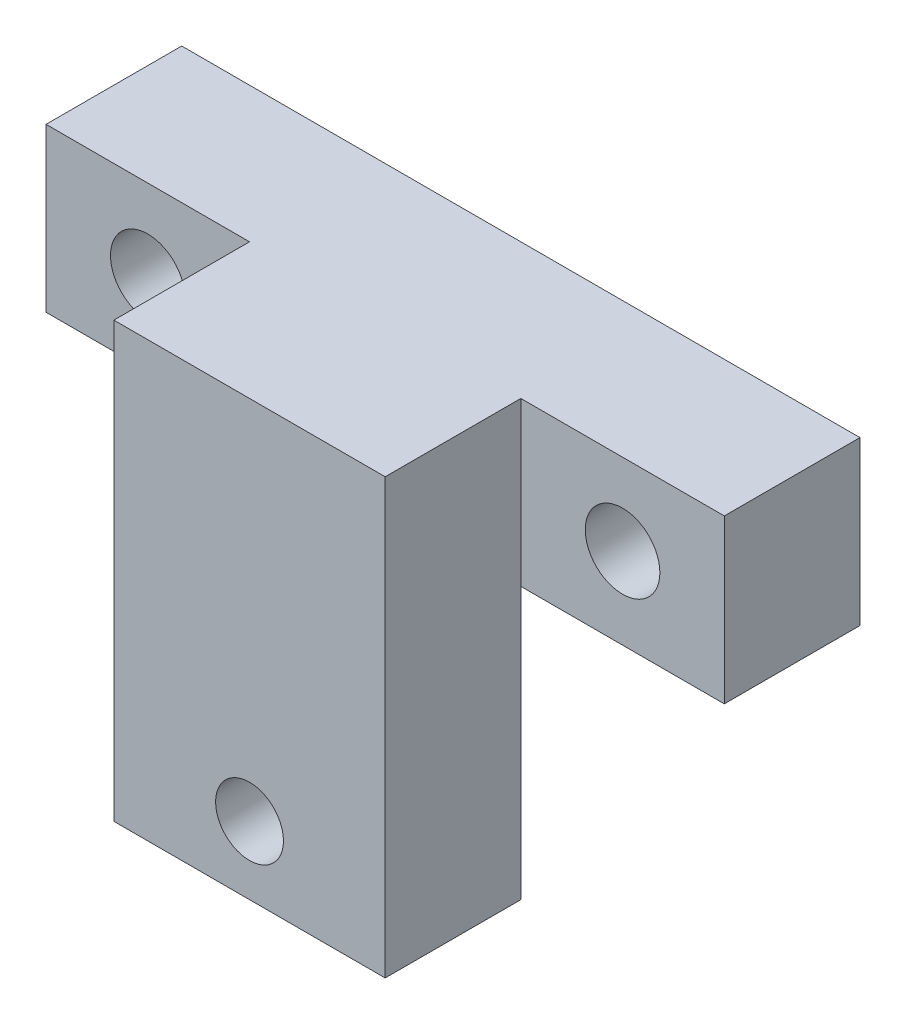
ISO-10303-21;
HEADER;
FILE_DESCRIPTION(('STEP AP214'),'2;1');
FILE_NAME('part.step','',(''),(''),'','','');
FILE_SCHEMA(('AUTOMOTIVE_DESIGN { 1 0 10303 214 1 1 1 1 }'));
ENDSEC;
DATA;
#1=APPLICATION_CONTEXT('core data for automotive mechanical design processes');
#2=APPLICATION_PROTOCOL_DEFINITION('international standard','automotive_design',2000,#1);
#3=PRODUCT_CONTEXT('',#1,'mechanical');
#4=PRODUCT('Part','Part','',(#3));
#5=PRODUCT_RELATED_PRODUCT_CATEGORY('part','',(#4));
#6=PRODUCT_DEFINITION_FORMATION('','',#4);
#7=PRODUCT_DEFINITION_CONTEXT('part definition',#1,'design');
#8=PRODUCT_DEFINITION('design','',#6,#7);
#9=PRODUCT_DEFINITION_SHAPE('','',#8);
#10=(LENGTH_UNIT() NAMED_UNIT(*) SI_UNIT(.MILLI.,.METRE.));
#11=(NAMED_UNIT(*) PLANE_ANGLE_UNIT() SI_UNIT($,.RADIAN.));
#12=(NAMED_UNIT(*) SI_UNIT($,.STERADIAN.) SOLID_ANGLE_UNIT());
#13=UNCERTAINTY_MEASURE_WITH_UNIT(LENGTH_MEASURE(1.E-05),#10,'distance_accuracy_value','');
#14=(GEOMETRIC_REPRESENTATION_CONTEXT(3) GLOBAL_UNCERTAINTY_ASSIGNED_CONTEXT((#13)) GLOBAL_UNIT_ASSIGNED_CONTEXT((#10,
#11,#12)) REPRESENTATION_CONTEXT('',''));
#15=CARTESIAN_POINT('',(0.,0.,0.));
#16=DIRECTION('',(0.,0.,1.));
#17=DIRECTION('',(1.,0.,0.));
#18=AXIS2_PLACEMENT_3D('',#15,#16,#17);
#19=CARTESIAN_POINT('',(35.,0.,20.));
#20=DIRECTION('',(0.,0.,1.));
#21=DIRECTION('',(1.,0.,0.));
#22=AXIS2_PLACEMENT_3D('',#19,#20,#21);
#23=PLANE('',#22);
#24=DIRECTION('',(0.,-1.,0.));
#25=VECTOR('',#24,1.);
#26=CARTESIAN_POINT('',(15.,0.,20.));
#27=LINE('',#26,#25);
#28=CARTESIAN_POINT('',(15.,32.,20.));
#29=VERTEX_POINT('',#28);
#30=CARTESIAN_POINT('',(15.,0.,20.));
#31=VERTEX_POINT('',#30);
#32=EDGE_CURVE('E119',#29,#31,#27,.T.);
#33=ORIENTED_EDGE('',*,*,#32,.T.);
#34=DIRECTION('',(1.,0.,0.));
#35=VECTOR('',#34,1.);
#36=CARTESIAN_POINT('',(15.,0.,20.));
#37=LINE('',#36,#35);
#38=CARTESIAN_POINT('',(35.,0.,20.));
#39=VERTEX_POINT('',#38);
#40=EDGE_CURVE('E165',#31,#39,#37,.T.);
#41=ORIENTED_EDGE('',*,*,#40,.T.);
#42=DIRECTION('',(0.,1.,0.));
#43=VECTOR('',#42,1.);
#44=CARTESIAN_POINT('',(35.,0.,20.));
#45=LINE('',#44,#43);
#46=CARTESIAN_POINT('',(35.,32.,20.));
#47=VERTEX_POINT('',#46);
#48=EDGE_CURVE('E168',#39,#47,#45,.T.);
#49=ORIENTED_EDGE('',*,*,#48,.T.);
#50=DIRECTION('',(-1.,0.,0.));
#51=VECTOR('',#50,1.);
#52=CARTESIAN_POINT('',(0.,32.,20.));
#53=LINE('',#52,#51);
#54=EDGE_CURVE('E171',#47,#29,#53,.T.);
#55=ORIENTED_EDGE('',*,*,#54,.T.);
#56=EDGE_LOOP('',(#33,#41,#49,#55));
#57=FACE_BOUND('',#56,.T.);
#58=CARTESIAN_POINT('',(25.,5.,20.));
#59=DIRECTION('',(0.,0.,1.));
#60=DIRECTION('',(1.,0.,0.));
#61=AXIS2_PLACEMENT_3D('',#58,#59,#60);
#62=CIRCLE('',#61,2.5);
#63=CARTESIAN_POINT('',(27.5,5.,20.));
#64=VERTEX_POINT('',#63);
#65=EDGE_CURVE('E154',#64,#64,#62,.T.);
#66=ORIENTED_EDGE('',*,*,#65,.F.);
#67=EDGE_LOOP('',(#66));
#68=FACE_BOUND('',#67,.T.);
#69=ADVANCED_FACE('F33',(#57,#68),#23,.T.);
#70=CARTESIAN_POINT('',(50.,20.,20.));
#71=DIRECTION('',(-1.,0.,0.));
#72=DIRECTION('',(0.,0.,1.));
#73=AXIS2_PLACEMENT_3D('',#70,#71,#72);
#74=PLANE('',#73);
#75=DIRECTION('',(0.,1.,0.));
#76=VECTOR('',#75,1.);
#77=CARTESIAN_POINT('',(50.,12.,10.));
#78=LINE('',#77,#76);
#79=CARTESIAN_POINT('',(50.,20.,10.));
#80=VERTEX_POINT('',#79);
#81=CARTESIAN_POINT('',(50.,32.,10.));
#82=VERTEX_POINT('',#81);
#83=EDGE_CURVE('E136',#80,#82,#78,.T.);
#84=ORIENTED_EDGE('',*,*,#83,.F.);
#85=DIRECTION('',(0.,0.,-1.));
#86=VECTOR('',#85,1.);
#87=CARTESIAN_POINT('',(50.,20.,20.));
#88=LINE('',#87,#86);
#89=CARTESIAN_POINT('',(50.,20.,0.));
#90=VERTEX_POINT('',#89);
#91=EDGE_CURVE('E42',#80,#90,#88,.T.);
#92=ORIENTED_EDGE('',*,*,#91,.T.);
#93=DIRECTION('',(0.,1.,0.));
#94=VECTOR('',#93,1.);
#95=CARTESIAN_POINT('',(50.,20.,0.));
#96=LINE('',#95,#94);
#97=CARTESIAN_POINT('',(50.,32.,0.));
#98=VERTEX_POINT('',#97);
#99=EDGE_CURVE('E164',#90,#98,#96,.T.);
#100=ORIENTED_EDGE('',*,*,#99,.T.);
#101=DIRECTION('',(0.,0.,-1.));
#102=VECTOR('',#101,1.);
#103=CARTESIAN_POINT('',(50.,32.,20.));
#104=LINE('',#103,#102);
#105=EDGE_CURVE('E188',#82,#98,#104,.T.);
#106=ORIENTED_EDGE('',*,*,#105,.F.);
#107=EDGE_LOOP('',(#84,#92,#100,#106));
#108=FACE_BOUND('',#107,.T.);
#109=ADVANCED_FACE('F209',(#108),#74,.F.);
#110=CARTESIAN_POINT('',(0.,32.,20.));
#111=DIRECTION('',(0.,-1.,0.));
#112=DIRECTION('',(0.,0.,-1.));
#113=AXIS2_PLACEMENT_3D('',#110,#111,#112);
#114=PLANE('',#113);
#115=DIRECTION('',(1.,0.,0.));
#116=VECTOR('',#115,1.);
#117=CARTESIAN_POINT('',(35.,32.,10.));
#118=LINE('',#117,#116);
#119=CARTESIAN_POINT('',(35.,32.,10.));
#120=VERTEX_POINT('',#119);
#121=EDGE_CURVE('E134',#120,#82,#118,.T.);
#122=ORIENTED_EDGE('',*,*,#121,.T.);
#123=ORIENTED_EDGE('',*,*,#105,.T.);
#124=DIRECTION('',(-1.,0.,0.));
#125=VECTOR('',#124,1.);
#126=CARTESIAN_POINT('',(0.,32.,0.));
#127=LINE('',#126,#125);
#128=CARTESIAN_POINT('',(0.,32.,0.));
#129=VERTEX_POINT('',#128);
#130=EDGE_CURVE('E177',#98,#129,#127,.T.);
#131=ORIENTED_EDGE('',*,*,#130,.T.);
#132=DIRECTION('',(0.,0.,-1.));
#133=VECTOR('',#132,1.);
#134=CARTESIAN_POINT('',(0.,32.,20.));
#135=LINE('',#134,#133);
#136=CARTESIAN_POINT('',(0.,32.,10.));
#137=VERTEX_POINT('',#136);
#138=EDGE_CURVE('E129',#137,#129,#135,.T.);
#139=ORIENTED_EDGE('',*,*,#138,.F.);
#140=DIRECTION('',(1.,0.,0.));
#141=VECTOR('',#140,1.);
#142=CARTESIAN_POINT('',(0.,32.,10.));
#143=LINE('',#142,#141);
#144=CARTESIAN_POINT('',(15.,32.,10.));
#145=VERTEX_POINT('',#144);
#146=EDGE_CURVE('E109',#137,#145,#143,.T.);
#147=ORIENTED_EDGE('',*,*,#146,.T.);
#148=DIRECTION('',(0.,0.,1.));
#149=VECTOR('',#148,1.);
#150=CARTESIAN_POINT('',(15.,32.,20.));
#151=LINE('',#150,#149);
#152=EDGE_CURVE('E116',#145,#29,#151,.T.);
#153=ORIENTED_EDGE('',*,*,#152,.T.);
#154=ORIENTED_EDGE('',*,*,#54,.F.);
#155=DIRECTION('',(0.,0.,-1.));
#156=VECTOR('',#155,1.);
#157=CARTESIAN_POINT('',(35.,32.,20.));
#158=LINE('',#157,#156);
#159=EDGE_CURVE('E123',#47,#120,#158,.T.);
#160=ORIENTED_EDGE('',*,*,#159,.T.);
#161=EDGE_LOOP('',(#122,#123,#131,#139,#147,#153,#154,#160));
#162=FACE_BOUND('',#161,.T.);
#163=ADVANCED_FACE('F127',(#162),#114,.F.);
#164=CARTESIAN_POINT('',(0.,20.,20.));
#165=DIRECTION('',(1.,0.,0.));
#166=DIRECTION('',(0.,0.,-1.));
#167=AXIS2_PLACEMENT_3D('',#164,#165,#166);
#168=PLANE('',#167);
#169=DIRECTION('',(0.,1.,0.));
#170=VECTOR('',#169,1.);
#171=CARTESIAN_POINT('',(0.,12.,10.));
#172=LINE('',#171,#170);
#173=CARTESIAN_POINT('',(0.,20.,10.));
#174=VERTEX_POINT('',#173);
#175=EDGE_CURVE('E50',#174,#137,#172,.T.);
#176=ORIENTED_EDGE('',*,*,#175,.T.);
#177=ORIENTED_EDGE('',*,*,#138,.T.);
#178=DIRECTION('',(0.,-1.,0.));
#179=VECTOR('',#178,1.);
#180=CARTESIAN_POINT('',(0.,20.,0.));
#181=LINE('',#180,#179);
#182=CARTESIAN_POINT('',(0.,20.,0.));
#183=VERTEX_POINT('',#182);
#184=EDGE_CURVE('E179',#129,#183,#181,.T.);
#185=ORIENTED_EDGE('',*,*,#184,.T.);
#186=DIRECTION('',(0.,0.,-1.));
#187=VECTOR('',#186,1.);
#188=CARTESIAN_POINT('',(0.,20.,20.));
#189=LINE('',#188,#187);
#190=EDGE_CURVE('E185',#174,#183,#189,.T.);
#191=ORIENTED_EDGE('',*,*,#190,.F.);
#192=EDGE_LOOP('',(#176,#177,#185,#191));
#193=FACE_BOUND('',#192,.T.);
#194=ADVANCED_FACE('F225',(#193),#168,.F.);
#195=CARTESIAN_POINT('',(0.,20.,20.));
#196=DIRECTION('',(0.,1.,0.));
#197=DIRECTION('',(0.,0.,1.));
#198=AXIS2_PLACEMENT_3D('',#195,#196,#197);
#199=PLANE('',#198);
#200=DIRECTION('',(1.,0.,0.));
#201=VECTOR('',#200,1.);
#202=CARTESIAN_POINT('',(0.,20.,10.));
#203=LINE('',#202,#201);
#204=CARTESIAN_POINT('',(35.,20.,10.));
#205=VERTEX_POINT('',#204);
#206=EDGE_CURVE('E141',#205,#80,#203,.T.);
#207=ORIENTED_EDGE('',*,*,#206,.F.);
#208=DIRECTION('',(1.,0.,0.));
#209=VECTOR('',#208,1.);
#210=CARTESIAN_POINT('',(-0.001000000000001,20.,9.99999999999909));
#211=LINE('',#210,#209);
#212=CARTESIAN_POINT('',(15.,20.,10.));
#213=VERTEX_POINT('',#212);
#214=EDGE_CURVE('E151',#213,#205,#211,.T.);
#215=ORIENTED_EDGE('',*,*,#214,.F.);
#216=DIRECTION('',(1.,0.,0.));
#217=VECTOR('',#216,1.);
#218=CARTESIAN_POINT('',(0.,20.,10.));
#219=LINE('',#218,#217);
#220=EDGE_CURVE('E110',#174,#213,#219,.T.);
#221=ORIENTED_EDGE('',*,*,#220,.F.);
#222=ORIENTED_EDGE('',*,*,#190,.T.);
#223=DIRECTION('',(1.,0.,0.));
#224=VECTOR('',#223,1.);
#225=CARTESIAN_POINT('',(0.,20.,0.));
#226=LINE('',#225,#224);
#227=EDGE_CURVE('E169',#183,#90,#226,.T.);
#228=ORIENTED_EDGE('',*,*,#227,.T.);
#229=ORIENTED_EDGE('',*,*,#91,.F.);
#230=EDGE_LOOP('',(#207,#215,#221,#222,#228,#229));
#231=FACE_BOUND('',#230,.T.);
#232=ADVANCED_FACE('F210',(#231),#199,.F.);
#233=CARTESIAN_POINT('',(7.5,26.,20.));
#234=DIRECTION('',(0.,0.,-1.));
#235=DIRECTION('',(-1.,0.,0.));
#236=AXIS2_PLACEMENT_3D('',#233,#234,#235);
#237=CYLINDRICAL_SURFACE('',#236,2.75);
#238=CARTESIAN_POINT('',(7.5,26.,0.));
#239=DIRECTION('',(0.,0.,1.));
#240=DIRECTION('',(1.,0.,0.));
#241=AXIS2_PLACEMENT_3D('',#238,#239,#240);
#242=CIRCLE('',#241,2.75);
#243=CARTESIAN_POINT('',(10.25,26.,0.));
#244=VERTEX_POINT('',#243);
#245=EDGE_CURVE('E161',#244,#244,#242,.T.);
#246=ORIENTED_EDGE('',*,*,#245,.F.);
#247=EDGE_LOOP('',(#246));
#248=FACE_BOUND('',#247,.T.);
#249=CARTESIAN_POINT('',(7.5,26.,10.));
#250=DIRECTION('',(0.,0.,1.));
#251=DIRECTION('',(1.,0.,0.));
#252=AXIS2_PLACEMENT_3D('',#249,#250,#251);
#253=CIRCLE('',#252,2.75);
#254=CARTESIAN_POINT('',(10.25,26.,10.));
#255=VERTEX_POINT('',#254);
#256=EDGE_CURVE('E37',#255,#255,#253,.T.);
#257=ORIENTED_EDGE('',*,*,#256,.T.);
#258=EDGE_LOOP('',(#257));
#259=FACE_BOUND('',#258,.T.);
#260=ADVANCED_FACE('F232',(#248,#259),#237,.F.);
#261=CARTESIAN_POINT('',(42.5,26.,20.));
#262=DIRECTION('',(0.,0.,-1.));
#263=DIRECTION('',(-1.,0.,0.));
#264=AXIS2_PLACEMENT_3D('',#261,#262,#263);
#265=CYLINDRICAL_SURFACE('',#264,2.75);
#266=CARTESIAN_POINT('',(42.5,26.,0.));
#267=DIRECTION('',(0.,0.,1.));
#268=DIRECTION('',(1.,0.,0.));
#269=AXIS2_PLACEMENT_3D('',#266,#267,#268);
#270=CIRCLE('',#269,2.75);
#271=CARTESIAN_POINT('',(45.25,26.,0.));
#272=VERTEX_POINT('',#271);
#273=EDGE_CURVE('E158',#272,#272,#270,.T.);
#274=ORIENTED_EDGE('',*,*,#273,.F.);
#275=EDGE_LOOP('',(#274));
#276=FACE_BOUND('',#275,.T.);
#277=CARTESIAN_POINT('',(42.5,26.,10.));
#278=DIRECTION('',(0.,0.,1.));
#279=DIRECTION('',(1.,0.,0.));
#280=AXIS2_PLACEMENT_3D('',#277,#278,#279);
#281=CIRCLE('',#280,2.75);
#282=CARTESIAN_POINT('',(45.25,26.,10.));
#283=VERTEX_POINT('',#282);
#284=EDGE_CURVE('E138',#283,#283,#281,.T.);
#285=ORIENTED_EDGE('',*,*,#284,.T.);
#286=EDGE_LOOP('',(#285));
#287=FACE_BOUND('',#286,.T.);
#288=ADVANCED_FACE('F193',(#276,#287),#265,.F.);
#289=CARTESIAN_POINT('',(35.,0.,0.));
#290=DIRECTION('',(0.,0.,1.));
#291=DIRECTION('',(1.,0.,0.));
#292=AXIS2_PLACEMENT_3D('',#289,#290,#291);
#293=PLANE('',#292);
#294=ORIENTED_EDGE('',*,*,#99,.F.);
#295=ORIENTED_EDGE('',*,*,#227,.F.);
#296=ORIENTED_EDGE('',*,*,#184,.F.);
#297=ORIENTED_EDGE('',*,*,#130,.F.);
#298=EDGE_LOOP('',(#294,#295,#296,#297));
#299=FACE_BOUND('',#298,.T.);
#300=ORIENTED_EDGE('',*,*,#273,.T.);
#301=EDGE_LOOP('',(#300));
#302=FACE_BOUND('',#301,.T.);
#303=ORIENTED_EDGE('',*,*,#245,.T.);
#304=EDGE_LOOP('',(#303));
#305=FACE_BOUND('',#304,.T.);
#306=ADVANCED_FACE('F217',(#299,#302,#305),#293,.F.);
#307=CARTESIAN_POINT('',(15.,0.,20.));
#308=DIRECTION('',(0.,1.,0.));
#309=DIRECTION('',(0.,0.,1.));
#310=AXIS2_PLACEMENT_3D('',#307,#308,#309);
#311=PLANE('',#310);
#312=DIRECTION('',(1.,0.,0.));
#313=VECTOR('',#312,1.);
#314=CARTESIAN_POINT('',(-0.001000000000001,0.,9.99999999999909));
#315=LINE('',#314,#313);
#316=CARTESIAN_POINT('',(15.,0.,9.99999999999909));
#317=VERTEX_POINT('',#316);
#318=CARTESIAN_POINT('',(35.,0.,9.99999999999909));
#319=VERTEX_POINT('',#318);
#320=EDGE_CURVE('E58',#317,#319,#315,.T.);
#321=ORIENTED_EDGE('',*,*,#320,.T.);
#322=DIRECTION('',(0.,0.,-1.));
#323=VECTOR('',#322,1.);
#324=CARTESIAN_POINT('',(35.,0.,20.));
#325=LINE('',#324,#323);
#326=EDGE_CURVE('E12',#39,#319,#325,.T.);
#327=ORIENTED_EDGE('',*,*,#326,.F.);
#328=ORIENTED_EDGE('',*,*,#40,.F.);
#329=DIRECTION('',(0.,0.,-1.));
#330=VECTOR('',#329,1.);
#331=CARTESIAN_POINT('',(15.,0.,20.));
#332=LINE('',#331,#330);
#333=EDGE_CURVE('E174',#31,#317,#332,.T.);
#334=ORIENTED_EDGE('',*,*,#333,.T.);
#335=EDGE_LOOP('',(#321,#327,#328,#334));
#336=FACE_BOUND('',#335,.T.);
#337=ADVANCED_FACE('F35',(#336),#311,.F.);
#338=CARTESIAN_POINT('',(35.,0.,20.));
#339=DIRECTION('',(-1.,0.,0.));
#340=DIRECTION('',(0.,0.,1.));
#341=AXIS2_PLACEMENT_3D('',#338,#339,#340);
#342=PLANE('',#341);
#343=ORIENTED_EDGE('',*,*,#159,.F.);
#344=ORIENTED_EDGE('',*,*,#48,.F.);
#345=ORIENTED_EDGE('',*,*,#326,.T.);
#346=DIRECTION('',(0.,1.,0.));
#347=VECTOR('',#346,1.);
#348=CARTESIAN_POINT('',(35.,0.,9.99999999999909));
#349=LINE('',#348,#347);
#350=EDGE_CURVE('E149',#319,#205,#349,.T.);
#351=ORIENTED_EDGE('',*,*,#350,.T.);
#352=DIRECTION('',(0.,1.,0.));
#353=VECTOR('',#352,1.);
#354=CARTESIAN_POINT('',(35.,12.,10.));
#355=LINE('',#354,#353);
#356=EDGE_CURVE('E113',#205,#120,#355,.T.);
#357=ORIENTED_EDGE('',*,*,#356,.T.);
#358=EDGE_LOOP('',(#343,#344,#345,#351,#357));
#359=FACE_BOUND('',#358,.T.);
#360=ADVANCED_FACE('F221',(#359),#342,.F.);
#361=CARTESIAN_POINT('',(15.,0.,20.));
#362=DIRECTION('',(1.,0.,0.));
#363=DIRECTION('',(0.,0.,-1.));
#364=AXIS2_PLACEMENT_3D('',#361,#362,#363);
#365=PLANE('',#364);
#366=DIRECTION('',(0.,-1.,0.));
#367=VECTOR('',#366,1.);
#368=CARTESIAN_POINT('',(15.,0.,9.99999999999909));
#369=LINE('',#368,#367);
#370=EDGE_CURVE('E147',#213,#317,#369,.T.);
#371=ORIENTED_EDGE('',*,*,#370,.T.);
#372=ORIENTED_EDGE('',*,*,#333,.F.);
#373=ORIENTED_EDGE('',*,*,#32,.F.);
#374=ORIENTED_EDGE('',*,*,#152,.F.);
#375=DIRECTION('',(0.,1.,0.));
#376=VECTOR('',#375,1.);
#377=CARTESIAN_POINT('',(15.,12.,10.));
#378=LINE('',#377,#376);
#379=EDGE_CURVE('E105',#213,#145,#378,.T.);
#380=ORIENTED_EDGE('',*,*,#379,.F.);
#381=EDGE_LOOP('',(#371,#372,#373,#374,#380));
#382=FACE_BOUND('',#381,.T.);
#383=ADVANCED_FACE('F117',(#382),#365,.F.);
#384=CARTESIAN_POINT('',(25.,5.,20.));
#385=DIRECTION('',(0.,0.,-1.));
#386=DIRECTION('',(-1.,0.,0.));
#387=AXIS2_PLACEMENT_3D('',#384,#385,#386);
#388=CYLINDRICAL_SURFACE('',#387,2.5);
#389=CARTESIAN_POINT('',(25.,5.,9.99999999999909));
#390=DIRECTION('',(0.,0.,-1.));
#391=DIRECTION('',(-1.,0.,0.));
#392=AXIS2_PLACEMENT_3D('',#389,#390,#391);
#393=CIRCLE('',#392,2.5);
#394=CARTESIAN_POINT('',(22.5,5.,9.99999999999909));
#395=VERTEX_POINT('',#394);
#396=EDGE_CURVE('E144',#395,#395,#393,.F.);
#397=ORIENTED_EDGE('',*,*,#396,.F.);
#398=EDGE_LOOP('',(#397));
#399=FACE_BOUND('',#398,.T.);
#400=ORIENTED_EDGE('',*,*,#65,.T.);
#401=EDGE_LOOP('',(#400));
#402=FACE_BOUND('',#401,.T.);
#403=ADVANCED_FACE('F249',(#399,#402),#388,.F.);
#404=CARTESIAN_POINT('',(-0.001000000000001,0.,9.99999999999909));
#405=DIRECTION('',(0.,0.,-1.));
#406=DIRECTION('',(-1.,0.,0.));
#407=AXIS2_PLACEMENT_3D('',#404,#405,#406);
#408=PLANE('',#407);
#409=ORIENTED_EDGE('',*,*,#396,.T.);
#410=EDGE_LOOP('',(#409));
#411=FACE_BOUND('',#410,.T.);
#412=ORIENTED_EDGE('',*,*,#350,.F.);
#413=ORIENTED_EDGE('',*,*,#320,.F.);
#414=ORIENTED_EDGE('',*,*,#370,.F.);
#415=ORIENTED_EDGE('',*,*,#214,.T.);
#416=EDGE_LOOP('',(#412,#413,#414,#415));
#417=FACE_BOUND('',#416,.T.);
#418=ADVANCED_FACE('F198',(#411,#417),#408,.T.);
#419=CARTESIAN_POINT('',(35.,12.,10.));
#420=DIRECTION('',(0.,0.,1.));
#421=DIRECTION('',(1.,0.,0.));
#422=AXIS2_PLACEMENT_3D('',#419,#420,#421);
#423=PLANE('',#422);
#424=ORIENTED_EDGE('',*,*,#284,.F.);
#425=EDGE_LOOP('',(#424));
#426=FACE_BOUND('',#425,.T.);
#427=ORIENTED_EDGE('',*,*,#206,.T.);
#428=ORIENTED_EDGE('',*,*,#83,.T.);
#429=ORIENTED_EDGE('',*,*,#121,.F.);
#430=ORIENTED_EDGE('',*,*,#356,.F.);
#431=EDGE_LOOP('',(#427,#428,#429,#430));
#432=FACE_BOUND('',#431,.T.);
#433=ADVANCED_FACE('F195',(#426,#432),#423,.T.);
#434=CARTESIAN_POINT('',(0.,12.,10.));
#435=DIRECTION('',(0.,0.,1.));
#436=DIRECTION('',(1.,0.,0.));
#437=AXIS2_PLACEMENT_3D('',#434,#435,#436);
#438=PLANE('',#437);
#439=ORIENTED_EDGE('',*,*,#256,.F.);
#440=EDGE_LOOP('',(#439));
#441=FACE_BOUND('',#440,.T.);
#442=ORIENTED_EDGE('',*,*,#220,.T.);
#443=ORIENTED_EDGE('',*,*,#379,.T.);
#444=ORIENTED_EDGE('',*,*,#146,.F.);
#445=ORIENTED_EDGE('',*,*,#175,.F.);
#446=EDGE_LOOP('',(#442,#443,#444,#445));
#447=FACE_BOUND('',#446,.T.);
#448=ADVANCED_FACE('F107',(#441,#447),#438,.T.);
#449=CLOSED_SHELL('',(#69,#109,#163,#194,#232,#260,#288,#306,#337,#360,#383,#403,#418,#433,#448));
#450=MANIFOLD_SOLID_BREP('B2',#449);
#451=ADVANCED_BREP_SHAPE_REPRESENTATION('',(#18,#450),#14);
#452=SHAPE_DEFINITION_REPRESENTATION(#9,#451);
ENDSEC;
END-ISO-10303-21;
